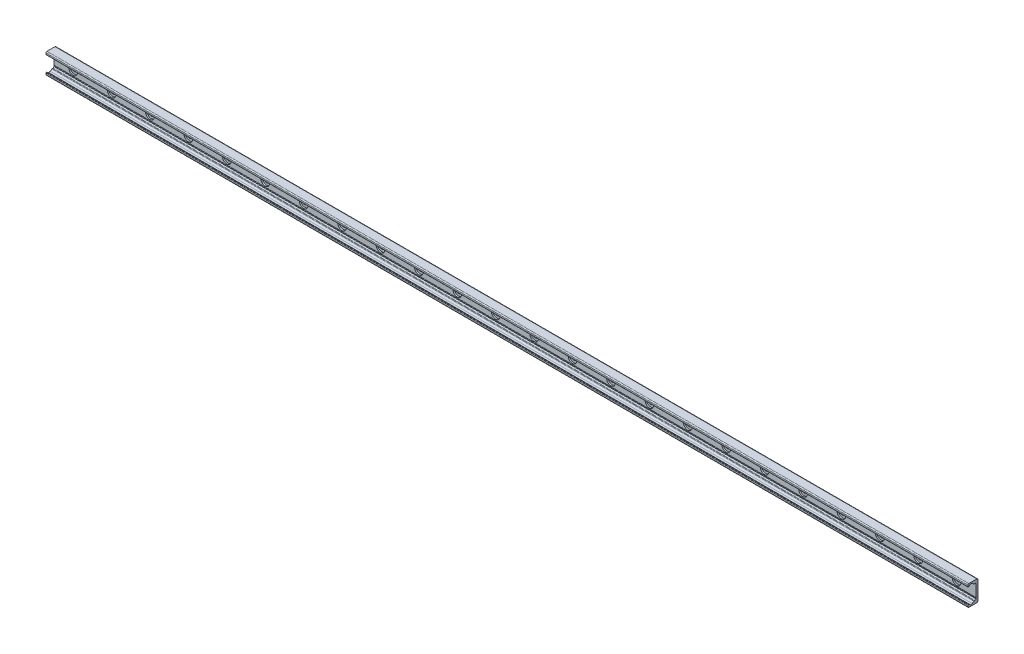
from build123d import *

# Parameters (mm, degrees)
BOSS_EXTRUDE1_DEPTH = 960
SKETCH2_R           = 9
SKETCH2_R_2         = 4.5
CUT_EXTRUDE1_DEPTH  = 3.1
SKETCH2_2_R         = 4.5
CUT_EXTRUDE2_DEPTH  = 961.382475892
LPATTERN1_COUNT     = 24
LPATTERN1_PITCH     = 80


with BuildPart() as part:
    # Sketch1 → Boss-Extrude1 (new, symmetric)
    with BuildSketch(Plane(origin=(0, 0, 0), x_dir=(0, 0, -1), z_dir=(1, 0, 0))):
        with BuildLine():
            Line((0, 0), (0, 19))
            ThreePointArc((0, 19), (-0.732233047, 20.767766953), (-2.5, 21.5))
            Line((-2.5, 21.5), (-19, 21.5))
            ThreePointArc((-19, 21.5), (-20.414213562, 20.914213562), (-21, 19.5))
            Line((-21, 19.5), (-21, 16.625057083))
            ThreePointArc((-21, 16.625057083), (-20.553251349, 15.888838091), (-19.693931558, 15.945160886))
            Line((-19.693931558, 15.945160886), (-16.794305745, 17.975500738))
            ThreePointArc((-16.794305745, 17.975500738), (-14.5, 18.69889256), (-12.205694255, 17.975500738))
            Line((-12.205694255, 17.975500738), (-8.829831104, 15.611695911))
            ThreePointArc((-8.829831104, 15.611695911), (-8.28408983, 15.342566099), (-7.682678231, 15.25))
            Line((-7.682678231, 15.25), (-6.5, 15.25))
            ThreePointArc((-6.5, 15.25), (-5.085786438, 14.664213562), (-4.5, 13.25))
            Line((-4.5, 13.25), (-4.5, -10.75))
            ThreePointArc((-4.5, -10.75), (-4.25, -11), (-4.5, -11.25))
            Line((-4.5, -11.25), (-4.5, -12.25))
            ThreePointArc((-4.5, -12.25), (-4.25, -12.5), (-4.5, -12.75))
            Line((-4.5, -12.75), (-4.5, -13.25))
            ThreePointArc((-4.5, -13.25), (-5.085786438, -14.664213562), (-6.5, -15.25))
            Line((-6.5, -15.25), (-7.682678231, -15.25))
            ThreePointArc((-7.682678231, -15.25), (-8.28408983, -15.342566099), (-8.829831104, -15.611695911))
            Line((-8.829831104, -15.611695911), (-12.205694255, -17.975500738))
            ThreePointArc((-12.205694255, -17.975500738), (-14.5, -18.69889256), (-16.794305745, -17.975500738))
            Line((-16.794305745, -17.975500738), (-19.693931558, -15.945160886))
            ThreePointArc((-19.693931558, -15.945160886), (-20.553251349, -15.888838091), (-21, -16.625057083))
            Line((-21, -16.625057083), (-21, -19.5))
            ThreePointArc((-21, -19.5), (-20.414213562, -20.914213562), (-19, -21.5))
            Line((-19, -21.5), (-2.5, -21.5))
            ThreePointArc((-2.5, -21.5), (-0.732233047, -20.767766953), (0, -19))
            Line((0, -19), (0, 0))
        make_face()
    extrude(amount=BOSS_EXTRUDE1_DEPTH, both=True)

    # Sketch2 → Cut-Extrude1 (cut)
    with BuildSketch(Plane.XY.offset(4.5)):
        with Locations((920, 0)):
            Circle(SKETCH2_R)
        with Locations((920, 0)):
            Circle(SKETCH2_R_2, mode=Mode.SUBTRACT)
    cut_extrude1 = extrude(amount=-CUT_EXTRUDE1_DEPTH, mode=Mode.SUBTRACT)

    # Sketch2_2 → Cut-Extrude2 (cut, through all)
    with BuildSketch(Plane.XY.offset(4.5)):
        with Locations((920, 0)):
            Circle(SKETCH2_2_R)
    cut_extrude2 = extrude(amount=-CUT_EXTRUDE2_DEPTH, mode=Mode.SUBTRACT)

    # LPattern1: Cut-Extrude1, Cut-Extrude2 ×24
    with Locations(*[(-i * LPATTERN1_PITCH, 0, 0) for i in range(1, LPATTERN1_COUNT)]):
        add(cut_extrude1, mode=Mode.SUBTRACT)
        add(cut_extrude2, mode=Mode.SUBTRACT)


solid = part.part
